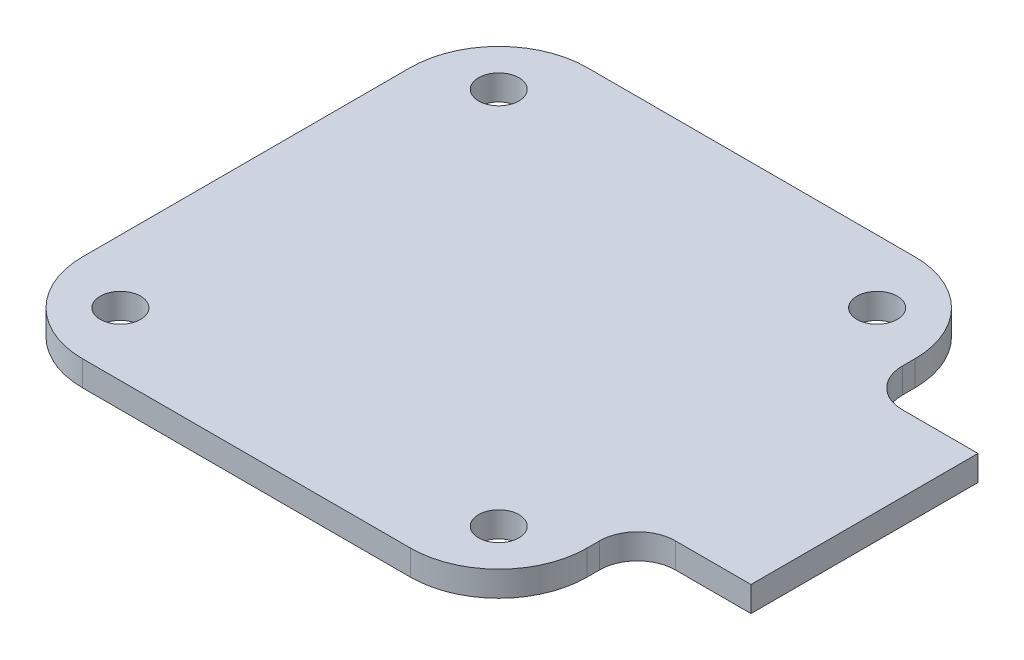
from build123d import *

# Parameters (mm, degrees)
EXTRUDE_1_DEPTH     = 2
SKETCH_2_R          = 1.6
CUT_EXTRUDE_1_DEPTH = 10


with BuildPart() as part:
    # Sketch 1 → Extrude 1 (new body)
    with BuildSketch(Plane(origin=(0, 0, 0), x_dir=(1, 0, 0), z_dir=(0, 1, 0))):
        with BuildLine():
            Line((-17.370811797, 19.620630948), (8.629188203, 19.620630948))
            ThreePointArc((8.629188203, 19.620630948), (13.578935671, 17.570378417), (15.629188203, 12.620630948))
            Line((15.629188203, 12.620630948), (15.629188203, 11.620630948))
            ThreePointArc((15.629188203, 11.620630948), (16.507867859, 9.499310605), (18.629188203, 8.620630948))
            Line((18.629188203, 8.620630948), (24.629188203, 8.620630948))
            Line((24.629188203, 8.620630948), (24.629188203, -9.379369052))
            Line((24.629188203, -9.379369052), (18.629188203, -9.379369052))
            ThreePointArc((18.629188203, -9.379369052), (16.507867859, -10.258048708), (15.629188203, -12.379369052))
            Line((15.629188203, -12.379369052), (15.629188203, -13.379369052))
            ThreePointArc((15.629188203, -13.379369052), (13.578935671, -18.32911652), (8.629188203, -20.379369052))
            Line((8.629188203, -20.379369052), (-17.370811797, -20.379369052))
            ThreePointArc((-17.370811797, -20.379369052), (-22.320559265, -18.32911652), (-24.370811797, -13.379369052))
            Line((-24.370811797, -13.379369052), (-24.370811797, 12.620630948))
            ThreePointArc((-24.370811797, 12.620630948), (-22.320559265, 17.570378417), (-17.370811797, 19.620630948))
        make_face()
    extrude(amount=EXTRUDE_1_DEPTH)

    # Sketch 2 → Cut-Extrude 1 (cut)
    with BuildSketch(Plane.XZ):
        with Locations(Location((-19.370811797, 15.379369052, 0), (0, 0, 270))):
            Circle(SKETCH_2_R)
        with Locations(Location((10.629188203, -14.620630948, 0), (0, 0, 270))):
            Circle(SKETCH_2_R)
        with Locations(Location((10.629188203, 15.379369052, 0), (0, 0, 270))):
            Circle(SKETCH_2_R)
        with Locations(Location((-19.370811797, -14.620630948, 0), (0, 0, 270))):
            Circle(SKETCH_2_R)
    extrude(amount=-CUT_EXTRUDE_1_DEPTH, mode=Mode.SUBTRACT)


solid = part.part
